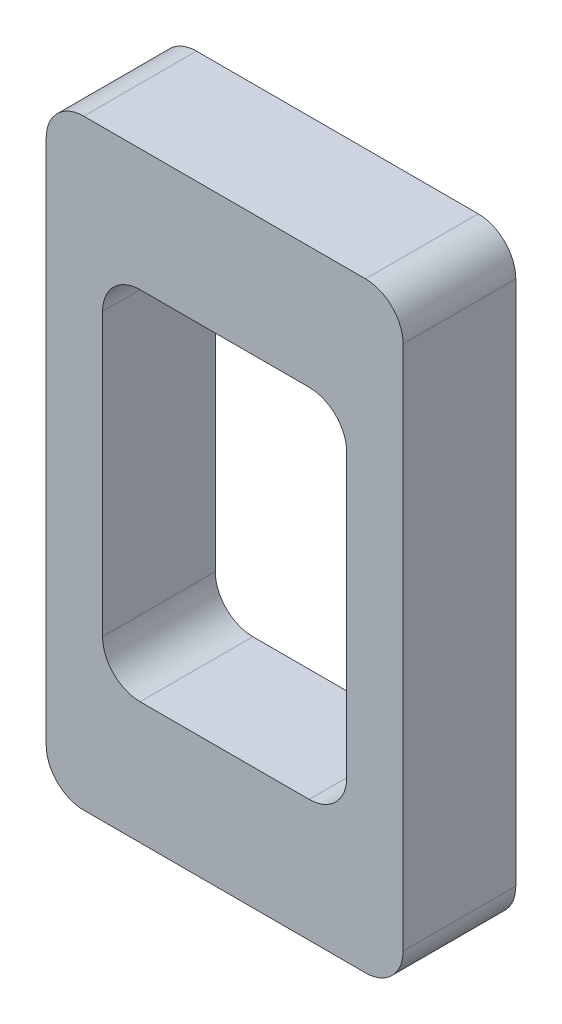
ISO-10303-21;
HEADER;
FILE_DESCRIPTION(('STEP AP214'),'2;1');
FILE_NAME('part.step','',(''),(''),'','','');
FILE_SCHEMA(('AUTOMOTIVE_DESIGN { 1 0 10303 214 1 1 1 1 }'));
ENDSEC;
DATA;
#1=APPLICATION_CONTEXT('core data for automotive mechanical design processes');
#2=APPLICATION_PROTOCOL_DEFINITION('international standard','automotive_design',2000,#1);
#3=PRODUCT_CONTEXT('',#1,'mechanical');
#4=PRODUCT('Part','Part','',(#3));
#5=PRODUCT_RELATED_PRODUCT_CATEGORY('part','',(#4));
#6=PRODUCT_DEFINITION_FORMATION('','',#4);
#7=PRODUCT_DEFINITION_CONTEXT('part definition',#1,'design');
#8=PRODUCT_DEFINITION('design','',#6,#7);
#9=PRODUCT_DEFINITION_SHAPE('','',#8);
#10=(LENGTH_UNIT() NAMED_UNIT(*) SI_UNIT(.MILLI.,.METRE.));
#11=(NAMED_UNIT(*) PLANE_ANGLE_UNIT() SI_UNIT($,.RADIAN.));
#12=(NAMED_UNIT(*) SI_UNIT($,.STERADIAN.) SOLID_ANGLE_UNIT());
#13=UNCERTAINTY_MEASURE_WITH_UNIT(LENGTH_MEASURE(1.E-05),#10,'distance_accuracy_value','');
#14=(GEOMETRIC_REPRESENTATION_CONTEXT(3) GLOBAL_UNCERTAINTY_ASSIGNED_CONTEXT((#13)) GLOBAL_UNIT_ASSIGNED_CONTEXT((#10,
#11,#12)) REPRESENTATION_CONTEXT('',''));
#15=CARTESIAN_POINT('',(0.,0.,0.));
#16=DIRECTION('',(0.,0.,1.));
#17=DIRECTION('',(1.,0.,0.));
#18=AXIS2_PLACEMENT_3D('',#15,#16,#17);
#19=CARTESIAN_POINT('',(-60.55,45.5897807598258,3.));
#20=DIRECTION('',(0.,0.,-1.));
#21=DIRECTION('',(-1.,0.,0.));
#22=AXIS2_PLACEMENT_3D('',#19,#20,#21);
#23=PLANE('',#22);
#24=DIRECTION('',(0.,-1.,0.));
#25=VECTOR('',#24,1.);
#26=CARTESIAN_POINT('',(-60.55,45.5897807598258,3.));
#27=LINE('',#26,#25);
#28=CARTESIAN_POINT('',(-60.55,44.5897807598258,3.));
#29=VERTEX_POINT('',#28);
#30=CARTESIAN_POINT('',(-60.55,30.5897807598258,3.));
#31=VERTEX_POINT('',#30);
#32=EDGE_CURVE('E283',#29,#31,#27,.T.);
#33=ORIENTED_EDGE('',*,*,#32,.T.);
#34=CARTESIAN_POINT('',(-59.55,30.5897807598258,3.));
#35=DIRECTION('',(0.,0.,-1.));
#36=DIRECTION('',(-1.,0.,0.));
#37=AXIS2_PLACEMENT_3D('',#34,#35,#36);
#38=CIRCLE('',#37,1.);
#39=CARTESIAN_POINT('',(-59.55,29.5897807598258,3.));
#40=VERTEX_POINT('',#39);
#41=EDGE_CURVE('E218',#31,#40,#38,.F.);
#42=ORIENTED_EDGE('',*,*,#41,.T.);
#43=DIRECTION('',(1.,0.,0.));
#44=VECTOR('',#43,1.);
#45=CARTESIAN_POINT('',(-51.05,29.5897807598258,3.));
#46=LINE('',#45,#44);
#47=CARTESIAN_POINT('',(-52.05,29.5897807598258,3.));
#48=VERTEX_POINT('',#47);
#49=EDGE_CURVE('E178',#40,#48,#46,.T.);
#50=ORIENTED_EDGE('',*,*,#49,.T.);
#51=CARTESIAN_POINT('',(-52.05,30.5897807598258,3.));
#52=DIRECTION('',(0.,0.,-1.));
#53=DIRECTION('',(-1.,0.,0.));
#54=AXIS2_PLACEMENT_3D('',#51,#52,#53);
#55=CIRCLE('',#54,1.);
#56=CARTESIAN_POINT('',(-51.05,30.5897807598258,3.));
#57=VERTEX_POINT('',#56);
#58=EDGE_CURVE('E56',#48,#57,#55,.F.);
#59=ORIENTED_EDGE('',*,*,#58,.T.);
#60=DIRECTION('',(0.,1.,0.));
#61=VECTOR('',#60,1.);
#62=CARTESIAN_POINT('',(-51.05,45.5897807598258,3.));
#63=LINE('',#62,#61);
#64=CARTESIAN_POINT('',(-51.05,44.5897807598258,3.));
#65=VERTEX_POINT('',#64);
#66=EDGE_CURVE('E174',#57,#65,#63,.T.);
#67=ORIENTED_EDGE('',*,*,#66,.T.);
#68=CARTESIAN_POINT('',(-52.05,44.5897807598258,3.));
#69=DIRECTION('',(0.,0.,-1.));
#70=DIRECTION('',(-1.,0.,0.));
#71=AXIS2_PLACEMENT_3D('',#68,#69,#70);
#72=CIRCLE('',#71,1.);
#73=CARTESIAN_POINT('',(-52.05,45.5897807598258,3.));
#74=VERTEX_POINT('',#73);
#75=EDGE_CURVE('E213',#65,#74,#72,.F.);
#76=ORIENTED_EDGE('',*,*,#75,.T.);
#77=DIRECTION('',(-1.,0.,0.));
#78=VECTOR('',#77,1.);
#79=CARTESIAN_POINT('',(-60.55,45.5897807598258,3.));
#80=LINE('',#79,#78);
#81=CARTESIAN_POINT('',(-59.55,45.5897807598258,3.));
#82=VERTEX_POINT('',#81);
#83=EDGE_CURVE('E280',#74,#82,#80,.T.);
#84=ORIENTED_EDGE('',*,*,#83,.T.);
#85=CARTESIAN_POINT('',(-59.55,44.5897807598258,3.));
#86=DIRECTION('',(0.,0.,-1.));
#87=DIRECTION('',(-1.,0.,0.));
#88=AXIS2_PLACEMENT_3D('',#85,#86,#87);
#89=CIRCLE('',#88,1.);
#90=EDGE_CURVE('E216',#82,#29,#89,.F.);
#91=ORIENTED_EDGE('',*,*,#90,.T.);
#92=EDGE_LOOP('',(#33,#42,#50,#59,#67,#76,#84,#91));
#93=FACE_BOUND('',#92,.T.);
#94=DIRECTION('',(1.,0.,0.));
#95=VECTOR('',#94,1.);
#96=CARTESIAN_POINT('',(-59.05,32.8397807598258,3.));
#97=LINE('',#96,#95);
#98=CARTESIAN_POINT('',(-58.05,32.8397807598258,3.));
#99=VERTEX_POINT('',#98);
#100=CARTESIAN_POINT('',(-53.55,32.8397807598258,3.));
#101=VERTEX_POINT('',#100);
#102=EDGE_CURVE('E260',#99,#101,#97,.T.);
#103=ORIENTED_EDGE('',*,*,#102,.F.);
#104=CARTESIAN_POINT('',(-58.05,33.8397807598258,3.));
#105=DIRECTION('',(0.,0.,-1.));
#106=DIRECTION('',(-1.,0.,0.));
#107=AXIS2_PLACEMENT_3D('',#104,#105,#106);
#108=CIRCLE('',#107,1.);
#109=CARTESIAN_POINT('',(-59.05,33.8397807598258,3.));
#110=VERTEX_POINT('',#109);
#111=EDGE_CURVE('E159',#99,#110,#108,.T.);
#112=ORIENTED_EDGE('',*,*,#111,.T.);
#113=DIRECTION('',(0.,-1.,0.));
#114=VECTOR('',#113,1.);
#115=CARTESIAN_POINT('',(-59.05,42.3397807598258,3.));
#116=LINE('',#115,#114);
#117=CARTESIAN_POINT('',(-59.05,41.3397807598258,3.));
#118=VERTEX_POINT('',#117);
#119=EDGE_CURVE('E262',#118,#110,#116,.T.);
#120=ORIENTED_EDGE('',*,*,#119,.F.);
#121=CARTESIAN_POINT('',(-58.05,41.3397807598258,3.));
#122=DIRECTION('',(0.,0.,-1.));
#123=DIRECTION('',(-1.,0.,0.));
#124=AXIS2_PLACEMENT_3D('',#121,#122,#123);
#125=CIRCLE('',#124,1.);
#126=CARTESIAN_POINT('',(-58.05,42.3397807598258,3.));
#127=VERTEX_POINT('',#126);
#128=EDGE_CURVE('E235',#118,#127,#125,.T.);
#129=ORIENTED_EDGE('',*,*,#128,.T.);
#130=DIRECTION('',(-1.,0.,0.));
#131=VECTOR('',#130,1.);
#132=CARTESIAN_POINT('',(-59.05,42.3397807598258,3.));
#133=LINE('',#132,#131);
#134=CARTESIAN_POINT('',(-53.55,42.3397807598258,3.));
#135=VERTEX_POINT('',#134);
#136=EDGE_CURVE('E256',#135,#127,#133,.T.);
#137=ORIENTED_EDGE('',*,*,#136,.F.);
#138=CARTESIAN_POINT('',(-53.55,41.3397807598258,3.));
#139=DIRECTION('',(0.,0.,-1.));
#140=DIRECTION('',(-1.,0.,0.));
#141=AXIS2_PLACEMENT_3D('',#138,#139,#140);
#142=CIRCLE('',#141,1.);
#143=CARTESIAN_POINT('',(-52.55,41.3397807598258,3.));
#144=VERTEX_POINT('',#143);
#145=EDGE_CURVE('E11',#135,#144,#142,.T.);
#146=ORIENTED_EDGE('',*,*,#145,.T.);
#147=DIRECTION('',(0.,1.,0.));
#148=VECTOR('',#147,1.);
#149=CARTESIAN_POINT('',(-52.55,42.3397807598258,3.));
#150=LINE('',#149,#148);
#151=CARTESIAN_POINT('',(-52.55,33.8397807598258,3.));
#152=VERTEX_POINT('',#151);
#153=EDGE_CURVE('E254',#152,#144,#150,.T.);
#154=ORIENTED_EDGE('',*,*,#153,.F.);
#155=CARTESIAN_POINT('',(-53.55,33.8397807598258,3.));
#156=DIRECTION('',(0.,0.,-1.));
#157=DIRECTION('',(-1.,0.,0.));
#158=AXIS2_PLACEMENT_3D('',#155,#156,#157);
#159=CIRCLE('',#158,1.);
#160=EDGE_CURVE('E160',#152,#101,#159,.T.);
#161=ORIENTED_EDGE('',*,*,#160,.T.);
#162=EDGE_LOOP('',(#103,#112,#120,#129,#137,#146,#154,#161));
#163=FACE_BOUND('',#162,.T.);
#164=ADVANCED_FACE('F34',(#93,#163),#23,.F.);
#165=CARTESIAN_POINT('',(-60.55,45.5897807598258,0.));
#166=DIRECTION('',(0.,0.,-1.));
#167=DIRECTION('',(-1.,0.,0.));
#168=AXIS2_PLACEMENT_3D('',#165,#166,#167);
#169=PLANE('',#168);
#170=DIRECTION('',(1.,0.,0.));
#171=VECTOR('',#170,1.);
#172=CARTESIAN_POINT('',(-51.05,29.5897807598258,0.));
#173=LINE('',#172,#171);
#174=CARTESIAN_POINT('',(-59.55,29.5897807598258,0.));
#175=VERTEX_POINT('',#174);
#176=CARTESIAN_POINT('',(-52.05,29.5897807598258,0.));
#177=VERTEX_POINT('',#176);
#178=EDGE_CURVE('E275',#175,#177,#173,.T.);
#179=ORIENTED_EDGE('',*,*,#178,.F.);
#180=CARTESIAN_POINT('',(-59.55,30.5897807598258,0.));
#181=DIRECTION('',(0.,0.,-1.));
#182=DIRECTION('',(-1.,0.,0.));
#183=AXIS2_PLACEMENT_3D('',#180,#181,#182);
#184=CIRCLE('',#183,1.);
#185=CARTESIAN_POINT('',(-60.55,30.5897807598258,0.));
#186=VERTEX_POINT('',#185);
#187=EDGE_CURVE('E206',#175,#186,#184,.T.);
#188=ORIENTED_EDGE('',*,*,#187,.T.);
#189=DIRECTION('',(0.,-1.,0.));
#190=VECTOR('',#189,1.);
#191=CARTESIAN_POINT('',(-60.55,45.5897807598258,0.));
#192=LINE('',#191,#190);
#193=CARTESIAN_POINT('',(-60.55,44.5897807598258,0.));
#194=VERTEX_POINT('',#193);
#195=EDGE_CURVE('E272',#194,#186,#192,.T.);
#196=ORIENTED_EDGE('',*,*,#195,.F.);
#197=CARTESIAN_POINT('',(-59.55,44.5897807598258,0.));
#198=DIRECTION('',(0.,0.,-1.));
#199=DIRECTION('',(-1.,0.,0.));
#200=AXIS2_PLACEMENT_3D('',#197,#198,#199);
#201=CIRCLE('',#200,1.);
#202=CARTESIAN_POINT('',(-59.55,45.5897807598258,0.));
#203=VERTEX_POINT('',#202);
#204=EDGE_CURVE('E204',#194,#203,#201,.T.);
#205=ORIENTED_EDGE('',*,*,#204,.T.);
#206=DIRECTION('',(-1.,0.,0.));
#207=VECTOR('',#206,1.);
#208=CARTESIAN_POINT('',(-60.55,45.5897807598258,0.));
#209=LINE('',#208,#207);
#210=CARTESIAN_POINT('',(-52.05,45.5897807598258,0.));
#211=VERTEX_POINT('',#210);
#212=EDGE_CURVE('E269',#211,#203,#209,.T.);
#213=ORIENTED_EDGE('',*,*,#212,.F.);
#214=CARTESIAN_POINT('',(-52.05,44.5897807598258,0.));
#215=DIRECTION('',(0.,0.,-1.));
#216=DIRECTION('',(-1.,0.,0.));
#217=AXIS2_PLACEMENT_3D('',#214,#215,#216);
#218=CIRCLE('',#217,1.);
#219=CARTESIAN_POINT('',(-51.05,44.5897807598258,0.));
#220=VERTEX_POINT('',#219);
#221=EDGE_CURVE('E200',#211,#220,#218,.T.);
#222=ORIENTED_EDGE('',*,*,#221,.T.);
#223=DIRECTION('',(0.,1.,0.));
#224=VECTOR('',#223,1.);
#225=CARTESIAN_POINT('',(-51.05,45.5897807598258,0.));
#226=LINE('',#225,#224);
#227=CARTESIAN_POINT('',(-51.05,30.5897807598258,0.));
#228=VERTEX_POINT('',#227);
#229=EDGE_CURVE('E278',#228,#220,#226,.T.);
#230=ORIENTED_EDGE('',*,*,#229,.F.);
#231=CARTESIAN_POINT('',(-52.05,30.5897807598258,0.));
#232=DIRECTION('',(0.,0.,-1.));
#233=DIRECTION('',(-1.,0.,0.));
#234=AXIS2_PLACEMENT_3D('',#231,#232,#233);
#235=CIRCLE('',#234,1.);
#236=EDGE_CURVE('E202',#228,#177,#235,.T.);
#237=ORIENTED_EDGE('',*,*,#236,.T.);
#238=EDGE_LOOP('',(#179,#188,#196,#205,#213,#222,#230,#237));
#239=FACE_BOUND('',#238,.T.);
#240=DIRECTION('',(-1.,0.,0.));
#241=VECTOR('',#240,1.);
#242=CARTESIAN_POINT('',(-59.05,42.3397807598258,0.));
#243=LINE('',#242,#241);
#244=CARTESIAN_POINT('',(-53.55,42.3397807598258,0.));
#245=VERTEX_POINT('',#244);
#246=CARTESIAN_POINT('',(-58.05,42.3397807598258,0.));
#247=VERTEX_POINT('',#246);
#248=EDGE_CURVE('E238',#245,#247,#243,.T.);
#249=ORIENTED_EDGE('',*,*,#248,.T.);
#250=CARTESIAN_POINT('',(-58.05,41.3397807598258,0.));
#251=DIRECTION('',(0.,0.,-1.));
#252=DIRECTION('',(-1.,0.,0.));
#253=AXIS2_PLACEMENT_3D('',#250,#251,#252);
#254=CIRCLE('',#253,1.);
#255=CARTESIAN_POINT('',(-59.05,41.3397807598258,0.));
#256=VERTEX_POINT('',#255);
#257=EDGE_CURVE('E233',#247,#256,#254,.F.);
#258=ORIENTED_EDGE('',*,*,#257,.T.);
#259=DIRECTION('',(0.,-1.,0.));
#260=VECTOR('',#259,1.);
#261=CARTESIAN_POINT('',(-59.05,42.3397807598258,0.));
#262=LINE('',#261,#260);
#263=CARTESIAN_POINT('',(-59.05,33.8397807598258,0.));
#264=VERTEX_POINT('',#263);
#265=EDGE_CURVE('E154',#256,#264,#262,.T.);
#266=ORIENTED_EDGE('',*,*,#265,.T.);
#267=CARTESIAN_POINT('',(-58.05,33.8397807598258,0.));
#268=DIRECTION('',(0.,0.,-1.));
#269=DIRECTION('',(-1.,0.,0.));
#270=AXIS2_PLACEMENT_3D('',#267,#268,#269);
#271=CIRCLE('',#270,1.);
#272=CARTESIAN_POINT('',(-58.05,32.8397807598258,0.));
#273=VERTEX_POINT('',#272);
#274=EDGE_CURVE('E148',#264,#273,#271,.F.);
#275=ORIENTED_EDGE('',*,*,#274,.T.);
#276=DIRECTION('',(1.,0.,0.));
#277=VECTOR('',#276,1.);
#278=CARTESIAN_POINT('',(-59.05,32.8397807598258,0.));
#279=LINE('',#278,#277);
#280=CARTESIAN_POINT('',(-53.55,32.8397807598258,0.));
#281=VERTEX_POINT('',#280);
#282=EDGE_CURVE('E152',#273,#281,#279,.T.);
#283=ORIENTED_EDGE('',*,*,#282,.T.);
#284=CARTESIAN_POINT('',(-53.55,33.8397807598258,0.));
#285=DIRECTION('',(0.,0.,-1.));
#286=DIRECTION('',(-1.,0.,0.));
#287=AXIS2_PLACEMENT_3D('',#284,#285,#286);
#288=CIRCLE('',#287,1.);
#289=CARTESIAN_POINT('',(-52.55,33.8397807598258,0.));
#290=VERTEX_POINT('',#289);
#291=EDGE_CURVE('E229',#281,#290,#288,.F.);
#292=ORIENTED_EDGE('',*,*,#291,.T.);
#293=DIRECTION('',(0.,1.,0.));
#294=VECTOR('',#293,1.);
#295=CARTESIAN_POINT('',(-52.55,42.3397807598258,0.));
#296=LINE('',#295,#294);
#297=CARTESIAN_POINT('',(-52.55,41.3397807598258,0.));
#298=VERTEX_POINT('',#297);
#299=EDGE_CURVE('E170',#290,#298,#296,.T.);
#300=ORIENTED_EDGE('',*,*,#299,.T.);
#301=CARTESIAN_POINT('',(-53.55,41.3397807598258,0.));
#302=DIRECTION('',(0.,0.,-1.));
#303=DIRECTION('',(-1.,0.,0.));
#304=AXIS2_PLACEMENT_3D('',#301,#302,#303);
#305=CIRCLE('',#304,1.);
#306=EDGE_CURVE('E42',#298,#245,#305,.F.);
#307=ORIENTED_EDGE('',*,*,#306,.T.);
#308=EDGE_LOOP('',(#249,#258,#266,#275,#283,#292,#300,#307));
#309=FACE_BOUND('',#308,.T.);
#310=ADVANCED_FACE('F151',(#239,#309),#169,.T.);
#311=CARTESIAN_POINT('',(-60.55,45.5897807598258,3.));
#312=DIRECTION('',(0.,-1.,0.));
#313=DIRECTION('',(0.,0.,-1.));
#314=AXIS2_PLACEMENT_3D('',#311,#312,#313);
#315=PLANE('',#314);
#316=ORIENTED_EDGE('',*,*,#212,.T.);
#317=DIRECTION('',(0.,0.,-1.));
#318=VECTOR('',#317,1.);
#319=CARTESIAN_POINT('',(-59.55,45.5897807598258,3.));
#320=LINE('',#319,#318);
#321=EDGE_CURVE('E223',#203,#82,#320,.F.);
#322=ORIENTED_EDGE('',*,*,#321,.T.);
#323=ORIENTED_EDGE('',*,*,#83,.F.);
#324=DIRECTION('',(0.,0.,-1.));
#325=VECTOR('',#324,1.);
#326=CARTESIAN_POINT('',(-52.05,45.5897807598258,3.));
#327=LINE('',#326,#325);
#328=EDGE_CURVE('E220',#74,#211,#327,.T.);
#329=ORIENTED_EDGE('',*,*,#328,.T.);
#330=EDGE_LOOP('',(#316,#322,#323,#329));
#331=FACE_BOUND('',#330,.T.);
#332=ADVANCED_FACE('F36',(#331),#315,.F.);
#333=CARTESIAN_POINT('',(-60.55,45.5897807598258,3.));
#334=DIRECTION('',(1.,0.,0.));
#335=DIRECTION('',(0.,0.,-1.));
#336=AXIS2_PLACEMENT_3D('',#333,#334,#335);
#337=PLANE('',#336);
#338=ORIENTED_EDGE('',*,*,#195,.T.);
#339=DIRECTION('',(0.,0.,-1.));
#340=VECTOR('',#339,1.);
#341=CARTESIAN_POINT('',(-60.55,30.5897807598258,3.));
#342=LINE('',#341,#340);
#343=EDGE_CURVE('E211',#186,#31,#342,.F.);
#344=ORIENTED_EDGE('',*,*,#343,.T.);
#345=ORIENTED_EDGE('',*,*,#32,.F.);
#346=DIRECTION('',(0.,0.,-1.));
#347=VECTOR('',#346,1.);
#348=CARTESIAN_POINT('',(-60.55,44.5897807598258,3.));
#349=LINE('',#348,#347);
#350=EDGE_CURVE('E208',#29,#194,#349,.T.);
#351=ORIENTED_EDGE('',*,*,#350,.T.);
#352=EDGE_LOOP('',(#338,#344,#345,#351));
#353=FACE_BOUND('',#352,.T.);
#354=ADVANCED_FACE('F312',(#353),#337,.F.);
#355=CARTESIAN_POINT('',(-51.05,29.5897807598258,3.));
#356=DIRECTION('',(0.,1.,0.));
#357=DIRECTION('',(0.,0.,1.));
#358=AXIS2_PLACEMENT_3D('',#355,#356,#357);
#359=PLANE('',#358);
#360=ORIENTED_EDGE('',*,*,#49,.F.);
#361=DIRECTION('',(0.,0.,-1.));
#362=VECTOR('',#361,1.);
#363=CARTESIAN_POINT('',(-59.55,29.5897807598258,3.));
#364=LINE('',#363,#362);
#365=EDGE_CURVE('E197',#40,#175,#364,.T.);
#366=ORIENTED_EDGE('',*,*,#365,.T.);
#367=ORIENTED_EDGE('',*,*,#178,.T.);
#368=DIRECTION('',(0.,0.,-1.));
#369=VECTOR('',#368,1.);
#370=CARTESIAN_POINT('',(-52.05,29.5897807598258,3.));
#371=LINE('',#370,#369);
#372=EDGE_CURVE('E195',#177,#48,#371,.F.);
#373=ORIENTED_EDGE('',*,*,#372,.T.);
#374=EDGE_LOOP('',(#360,#366,#367,#373));
#375=FACE_BOUND('',#374,.T.);
#376=ADVANCED_FACE('F316',(#375),#359,.F.);
#377=CARTESIAN_POINT('',(-51.05,45.5897807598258,3.));
#378=DIRECTION('',(-1.,0.,0.));
#379=DIRECTION('',(0.,-1.,0.));
#380=AXIS2_PLACEMENT_3D('',#377,#378,#379);
#381=PLANE('',#380);
#382=ORIENTED_EDGE('',*,*,#66,.F.);
#383=DIRECTION('',(0.,0.,-1.));
#384=VECTOR('',#383,1.);
#385=CARTESIAN_POINT('',(-51.05,30.5897807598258,3.));
#386=LINE('',#385,#384);
#387=EDGE_CURVE('E226',#57,#228,#386,.T.);
#388=ORIENTED_EDGE('',*,*,#387,.T.);
#389=ORIENTED_EDGE('',*,*,#229,.T.);
#390=DIRECTION('',(0.,0.,-1.));
#391=VECTOR('',#390,1.);
#392=CARTESIAN_POINT('',(-51.05,44.5897807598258,3.));
#393=LINE('',#392,#391);
#394=EDGE_CURVE('E49',#220,#65,#393,.F.);
#395=ORIENTED_EDGE('',*,*,#394,.T.);
#396=EDGE_LOOP('',(#382,#388,#389,#395));
#397=FACE_BOUND('',#396,.T.);
#398=ADVANCED_FACE('F294',(#397),#381,.F.);
#399=CARTESIAN_POINT('',(-59.05,32.8397807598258,3.));
#400=DIRECTION('',(0.,1.,0.));
#401=DIRECTION('',(0.,0.,1.));
#402=AXIS2_PLACEMENT_3D('',#399,#400,#401);
#403=PLANE('',#402);
#404=ORIENTED_EDGE('',*,*,#102,.T.);
#405=DIRECTION('',(0.,0.,-1.));
#406=VECTOR('',#405,1.);
#407=CARTESIAN_POINT('',(-53.55,32.8397807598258,0.));
#408=LINE('',#407,#406);
#409=EDGE_CURVE('E169',#101,#281,#408,.T.);
#410=ORIENTED_EDGE('',*,*,#409,.T.);
#411=ORIENTED_EDGE('',*,*,#282,.F.);
#412=DIRECTION('',(0.,0.,-1.));
#413=VECTOR('',#412,1.);
#414=CARTESIAN_POINT('',(-58.05,32.8397807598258,3.));
#415=LINE('',#414,#413);
#416=EDGE_CURVE('E166',#273,#99,#415,.F.);
#417=ORIENTED_EDGE('',*,*,#416,.T.);
#418=EDGE_LOOP('',(#404,#410,#411,#417));
#419=FACE_BOUND('',#418,.T.);
#420=ADVANCED_FACE('F165',(#419),#403,.T.);
#421=CARTESIAN_POINT('',(-52.55,42.3397807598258,3.));
#422=DIRECTION('',(-1.,0.,0.));
#423=DIRECTION('',(0.,0.,1.));
#424=AXIS2_PLACEMENT_3D('',#421,#422,#423);
#425=PLANE('',#424);
#426=ORIENTED_EDGE('',*,*,#299,.F.);
#427=DIRECTION('',(0.,0.,-1.));
#428=VECTOR('',#427,1.);
#429=CARTESIAN_POINT('',(-52.55,33.8397807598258,3.));
#430=LINE('',#429,#428);
#431=EDGE_CURVE('E184',#290,#152,#430,.F.);
#432=ORIENTED_EDGE('',*,*,#431,.T.);
#433=ORIENTED_EDGE('',*,*,#153,.T.);
#434=DIRECTION('',(0.,0.,-1.));
#435=VECTOR('',#434,1.);
#436=CARTESIAN_POINT('',(-52.55,41.3397807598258,0.));
#437=LINE('',#436,#435);
#438=EDGE_CURVE('E176',#144,#298,#437,.T.);
#439=ORIENTED_EDGE('',*,*,#438,.T.);
#440=EDGE_LOOP('',(#426,#432,#433,#439));
#441=FACE_BOUND('',#440,.T.);
#442=ADVANCED_FACE('F258',(#441),#425,.T.);
#443=CARTESIAN_POINT('',(-59.05,42.3397807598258,3.));
#444=DIRECTION('',(0.,-1.,0.));
#445=DIRECTION('',(0.,0.,-1.));
#446=AXIS2_PLACEMENT_3D('',#443,#444,#445);
#447=PLANE('',#446);
#448=ORIENTED_EDGE('',*,*,#136,.T.);
#449=DIRECTION('',(0.,0.,-1.));
#450=VECTOR('',#449,1.);
#451=CARTESIAN_POINT('',(-58.05,42.3397807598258,0.));
#452=LINE('',#451,#450);
#453=EDGE_CURVE('E192',#127,#247,#452,.T.);
#454=ORIENTED_EDGE('',*,*,#453,.T.);
#455=ORIENTED_EDGE('',*,*,#248,.F.);
#456=DIRECTION('',(0.,0.,-1.));
#457=VECTOR('',#456,1.);
#458=CARTESIAN_POINT('',(-53.55,42.3397807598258,3.));
#459=LINE('',#458,#457);
#460=EDGE_CURVE('E190',#245,#135,#459,.F.);
#461=ORIENTED_EDGE('',*,*,#460,.T.);
#462=EDGE_LOOP('',(#448,#454,#455,#461));
#463=FACE_BOUND('',#462,.T.);
#464=ADVANCED_FACE('F245',(#463),#447,.T.);
#465=CARTESIAN_POINT('',(-59.05,42.3397807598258,3.));
#466=DIRECTION('',(1.,0.,0.));
#467=DIRECTION('',(0.,0.,-1.));
#468=AXIS2_PLACEMENT_3D('',#465,#466,#467);
#469=PLANE('',#468);
#470=ORIENTED_EDGE('',*,*,#119,.T.);
#471=DIRECTION('',(0.,0.,-1.));
#472=VECTOR('',#471,1.);
#473=CARTESIAN_POINT('',(-59.05,33.8397807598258,0.));
#474=LINE('',#473,#472);
#475=EDGE_CURVE('E188',#110,#264,#474,.T.);
#476=ORIENTED_EDGE('',*,*,#475,.T.);
#477=ORIENTED_EDGE('',*,*,#265,.F.);
#478=DIRECTION('',(0.,0.,-1.));
#479=VECTOR('',#478,1.);
#480=CARTESIAN_POINT('',(-59.05,41.3397807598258,3.));
#481=LINE('',#480,#479);
#482=EDGE_CURVE('E186',#256,#118,#481,.F.);
#483=ORIENTED_EDGE('',*,*,#482,.T.);
#484=EDGE_LOOP('',(#470,#476,#477,#483));
#485=FACE_BOUND('',#484,.T.);
#486=ADVANCED_FACE('F337',(#485),#469,.T.);
#487=CARTESIAN_POINT('',(-53.55,33.8397807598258,3.));
#488=DIRECTION('',(0.,0.,1.));
#489=DIRECTION('',(1.,0.,0.));
#490=AXIS2_PLACEMENT_3D('',#487,#488,#489);
#491=CYLINDRICAL_SURFACE('',#490,1.);
#492=ORIENTED_EDGE('',*,*,#160,.F.);
#493=ORIENTED_EDGE('',*,*,#431,.F.);
#494=ORIENTED_EDGE('',*,*,#291,.F.);
#495=ORIENTED_EDGE('',*,*,#409,.F.);
#496=EDGE_LOOP('',(#492,#493,#494,#495));
#497=FACE_BOUND('',#496,.T.);
#498=ADVANCED_FACE('F340',(#497),#491,.F.);
#499=CARTESIAN_POINT('',(-58.05,33.8397807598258,3.));
#500=DIRECTION('',(0.,0.,1.));
#501=DIRECTION('',(1.,0.,0.));
#502=AXIS2_PLACEMENT_3D('',#499,#500,#501);
#503=CYLINDRICAL_SURFACE('',#502,1.);
#504=ORIENTED_EDGE('',*,*,#111,.F.);
#505=ORIENTED_EDGE('',*,*,#416,.F.);
#506=ORIENTED_EDGE('',*,*,#274,.F.);
#507=ORIENTED_EDGE('',*,*,#475,.F.);
#508=EDGE_LOOP('',(#504,#505,#506,#507));
#509=FACE_BOUND('',#508,.T.);
#510=ADVANCED_FACE('F173',(#509),#503,.F.);
#511=CARTESIAN_POINT('',(-58.05,41.3397807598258,3.));
#512=DIRECTION('',(0.,0.,1.));
#513=DIRECTION('',(1.,0.,0.));
#514=AXIS2_PLACEMENT_3D('',#511,#512,#513);
#515=CYLINDRICAL_SURFACE('',#514,1.);
#516=ORIENTED_EDGE('',*,*,#128,.F.);
#517=ORIENTED_EDGE('',*,*,#482,.F.);
#518=ORIENTED_EDGE('',*,*,#257,.F.);
#519=ORIENTED_EDGE('',*,*,#453,.F.);
#520=EDGE_LOOP('',(#516,#517,#518,#519));
#521=FACE_BOUND('',#520,.T.);
#522=ADVANCED_FACE('F347',(#521),#515,.F.);
#523=CARTESIAN_POINT('',(-53.55,41.3397807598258,3.));
#524=DIRECTION('',(0.,0.,1.));
#525=DIRECTION('',(1.,0.,0.));
#526=AXIS2_PLACEMENT_3D('',#523,#524,#525);
#527=CYLINDRICAL_SURFACE('',#526,1.);
#528=ORIENTED_EDGE('',*,*,#145,.F.);
#529=ORIENTED_EDGE('',*,*,#460,.F.);
#530=ORIENTED_EDGE('',*,*,#306,.F.);
#531=ORIENTED_EDGE('',*,*,#438,.F.);
#532=EDGE_LOOP('',(#528,#529,#530,#531));
#533=FACE_BOUND('',#532,.T.);
#534=ADVANCED_FACE('F250',(#533),#527,.F.);
#535=CARTESIAN_POINT('',(-59.55,30.5897807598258,3.));
#536=DIRECTION('',(0.,0.,-1.));
#537=DIRECTION('',(-1.,0.,0.));
#538=AXIS2_PLACEMENT_3D('',#535,#536,#537);
#539=CYLINDRICAL_SURFACE('',#538,1.);
#540=ORIENTED_EDGE('',*,*,#41,.F.);
#541=ORIENTED_EDGE('',*,*,#343,.F.);
#542=ORIENTED_EDGE('',*,*,#187,.F.);
#543=ORIENTED_EDGE('',*,*,#365,.F.);
#544=EDGE_LOOP('',(#540,#541,#542,#543));
#545=FACE_BOUND('',#544,.T.);
#546=ADVANCED_FACE('F315',(#545),#539,.T.);
#547=CARTESIAN_POINT('',(-59.55,44.5897807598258,3.));
#548=DIRECTION('',(0.,0.,-1.));
#549=DIRECTION('',(-1.,0.,0.));
#550=AXIS2_PLACEMENT_3D('',#547,#548,#549);
#551=CYLINDRICAL_SURFACE('',#550,1.);
#552=ORIENTED_EDGE('',*,*,#90,.F.);
#553=ORIENTED_EDGE('',*,*,#321,.F.);
#554=ORIENTED_EDGE('',*,*,#204,.F.);
#555=ORIENTED_EDGE('',*,*,#350,.F.);
#556=EDGE_LOOP('',(#552,#553,#554,#555));
#557=FACE_BOUND('',#556,.T.);
#558=ADVANCED_FACE('F309',(#557),#551,.T.);
#559=CARTESIAN_POINT('',(-52.05,30.5897807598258,3.));
#560=DIRECTION('',(0.,0.,-1.));
#561=DIRECTION('',(-1.,0.,0.));
#562=AXIS2_PLACEMENT_3D('',#559,#560,#561);
#563=CYLINDRICAL_SURFACE('',#562,1.);
#564=ORIENTED_EDGE('',*,*,#58,.F.);
#565=ORIENTED_EDGE('',*,*,#372,.F.);
#566=ORIENTED_EDGE('',*,*,#236,.F.);
#567=ORIENTED_EDGE('',*,*,#387,.F.);
#568=EDGE_LOOP('',(#564,#565,#566,#567));
#569=FACE_BOUND('',#568,.T.);
#570=ADVANCED_FACE('F292',(#569),#563,.T.);
#571=CARTESIAN_POINT('',(-52.05,44.5897807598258,3.));
#572=DIRECTION('',(0.,0.,-1.));
#573=DIRECTION('',(-1.,0.,0.));
#574=AXIS2_PLACEMENT_3D('',#571,#572,#573);
#575=CYLINDRICAL_SURFACE('',#574,1.);
#576=ORIENTED_EDGE('',*,*,#75,.F.);
#577=ORIENTED_EDGE('',*,*,#394,.F.);
#578=ORIENTED_EDGE('',*,*,#221,.F.);
#579=ORIENTED_EDGE('',*,*,#328,.F.);
#580=EDGE_LOOP('',(#576,#577,#578,#579));
#581=FACE_BOUND('',#580,.T.);
#582=ADVANCED_FACE('F301',(#581),#575,.T.);
#583=CLOSED_SHELL('',(#164,#310,#332,#354,#376,#398,#420,#442,#464,#486,#498,#510,#522,#534,
#546,#558,#570,#582));
#584=MANIFOLD_SOLID_BREP('B2',#583);
#585=ADVANCED_BREP_SHAPE_REPRESENTATION('',(#18,#584),#14);
#586=SHAPE_DEFINITION_REPRESENTATION(#9,#585);
ENDSEC;
END-ISO-10303-21;
